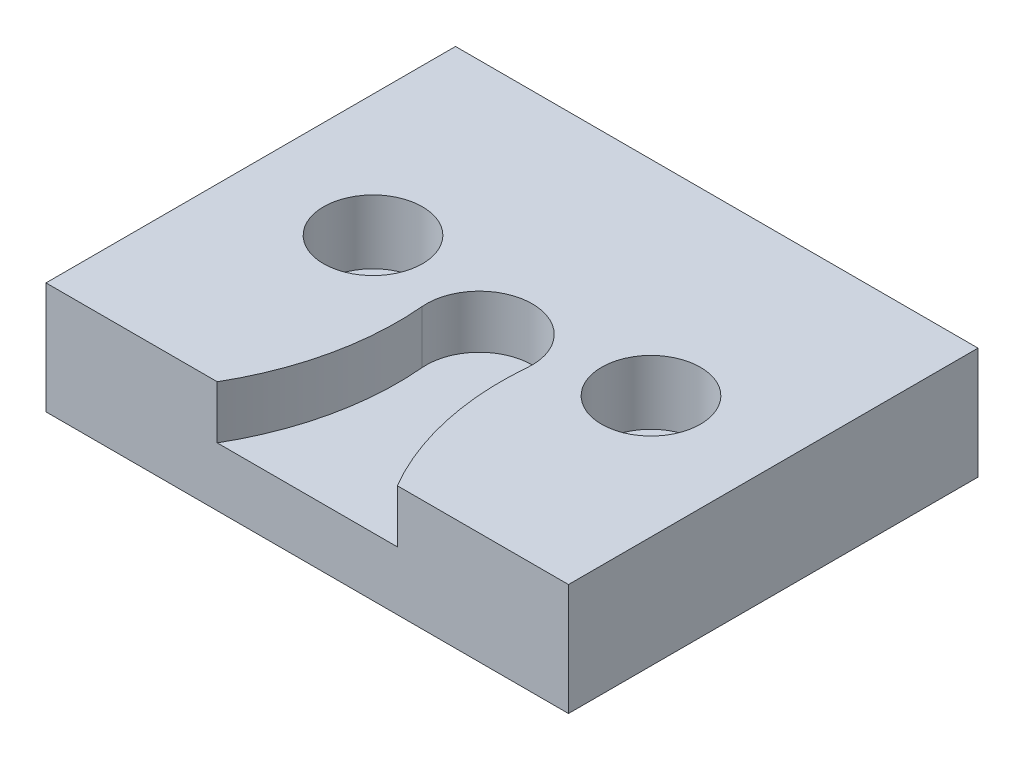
ISO-10303-21;
HEADER;
FILE_DESCRIPTION(('STEP AP214'),'2;1');
FILE_NAME('part.step','',(''),(''),'','','');
FILE_SCHEMA(('AUTOMOTIVE_DESIGN { 1 0 10303 214 1 1 1 1 }'));
ENDSEC;
DATA;
#1=APPLICATION_CONTEXT('core data for automotive mechanical design processes');
#2=APPLICATION_PROTOCOL_DEFINITION('international standard','automotive_design',2000,#1);
#3=PRODUCT_CONTEXT('',#1,'mechanical');
#4=PRODUCT('Part','Part','',(#3));
#5=PRODUCT_RELATED_PRODUCT_CATEGORY('part','',(#4));
#6=PRODUCT_DEFINITION_FORMATION('','',#4);
#7=PRODUCT_DEFINITION_CONTEXT('part definition',#1,'design');
#8=PRODUCT_DEFINITION('design','',#6,#7);
#9=PRODUCT_DEFINITION_SHAPE('','',#8);
#10=(LENGTH_UNIT() NAMED_UNIT(*) SI_UNIT(.MILLI.,.METRE.));
#11=(NAMED_UNIT(*) PLANE_ANGLE_UNIT() SI_UNIT($,.RADIAN.));
#12=(NAMED_UNIT(*) SI_UNIT($,.STERADIAN.) SOLID_ANGLE_UNIT());
#13=UNCERTAINTY_MEASURE_WITH_UNIT(LENGTH_MEASURE(1.E-05),#10,'distance_accuracy_value','');
#14=(GEOMETRIC_REPRESENTATION_CONTEXT(3) GLOBAL_UNCERTAINTY_ASSIGNED_CONTEXT((#13)) GLOBAL_UNIT_ASSIGNED_CONTEXT((#10,
#11,#12)) REPRESENTATION_CONTEXT('',''));
#15=CARTESIAN_POINT('',(0.,0.,0.));
#16=DIRECTION('',(0.,0.,1.));
#17=DIRECTION('',(1.,0.,0.));
#18=AXIS2_PLACEMENT_3D('',#15,#16,#17);
#19=CARTESIAN_POINT('',(0.,0.,0.));
#20=DIRECTION('',(0.,1.,0.));
#21=DIRECTION('',(0.,0.,1.));
#22=AXIS2_PLACEMENT_3D('',#19,#20,#21);
#23=PLANE('',#22);
#24=CARTESIAN_POINT('',(24.99995,0.,0.));
#25=DIRECTION('',(0.,1.,0.));
#26=DIRECTION('',(0.,0.,1.));
#27=AXIS2_PLACEMENT_3D('',#24,#25,#26);
#28=CIRCLE('',#27,8.89);
#29=CARTESIAN_POINT('',(24.99995,0.,8.89));
#30=VERTEX_POINT('',#29);
#31=EDGE_CURVE('E181',#30,#30,#28,.T.);
#32=ORIENTED_EDGE('',*,*,#31,.F.);
#33=EDGE_LOOP('',(#32));
#34=FACE_BOUND('',#33,.T.);
#35=CARTESIAN_POINT('',(-24.99995,0.,0.));
#36=DIRECTION('',(0.,1.,0.));
#37=DIRECTION('',(0.,0.,1.));
#38=AXIS2_PLACEMENT_3D('',#35,#36,#37);
#39=CIRCLE('',#38,8.89);
#40=CARTESIAN_POINT('',(-24.99995,0.,8.89));
#41=VERTEX_POINT('',#40);
#42=EDGE_CURVE('E165',#41,#41,#39,.T.);
#43=ORIENTED_EDGE('',*,*,#42,.F.);
#44=EDGE_LOOP('',(#43));
#45=FACE_BOUND('',#44,.T.);
#46=CARTESIAN_POINT('',(-60.0847810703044,0.,11.2524782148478));
#47=DIRECTION('',(0.,-1.,0.));
#48=DIRECTION('',(0.,0.,1.));
#49=AXIS2_PLACEMENT_3D('',#46,#47,#48);
#50=CIRCLE('',#49,50.8);
#51=CARTESIAN_POINT('',(-9.48711280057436,0.,6.72302287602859));
#52=VERTEX_POINT('',#51);
#53=CARTESIAN_POINT('',(-16.1936614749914,0.,36.83));
#54=VERTEX_POINT('',#53);
#55=EDGE_CURVE('E142',#52,#54,#50,.T.);
#56=ORIENTED_EDGE('',*,*,#55,.F.);
#57=CARTESIAN_POINT('',(-4.9999999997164E-05,0.,5.87374999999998));
#58=DIRECTION('',(0.,1.,0.));
#59=DIRECTION('',(0.,0.,1.));
#60=AXIS2_PLACEMENT_3D('',#57,#58,#59);
#61=CIRCLE('',#60,9.52499999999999);
#62=CARTESIAN_POINT('',(9.48701280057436,0.,6.72302287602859));
#63=VERTEX_POINT('',#62);
#64=EDGE_CURVE('E158',#63,#52,#61,.T.);
#65=ORIENTED_EDGE('',*,*,#64,.F.);
#66=CARTESIAN_POINT('',(60.0846810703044,0.,11.2524782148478));
#67=DIRECTION('',(0.,1.,0.));
#68=DIRECTION('',(0.,0.,1.));
#69=AXIS2_PLACEMENT_3D('',#66,#67,#68);
#70=CIRCLE('',#69,50.8);
#71=CARTESIAN_POINT('',(16.1935614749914,0.,36.83));
#72=VERTEX_POINT('',#71);
#73=EDGE_CURVE('E55',#72,#63,#70,.F.);
#74=ORIENTED_EDGE('',*,*,#73,.F.);
#75=DIRECTION('',(1.,0.,0.));
#76=VECTOR('',#75,1.);
#77=CARTESIAN_POINT('',(-46.99,0.,36.83));
#78=LINE('',#77,#76);
#79=CARTESIAN_POINT('',(46.99,0.,36.83));
#80=VERTEX_POINT('',#79);
#81=EDGE_CURVE('E264',#72,#80,#78,.T.);
#82=ORIENTED_EDGE('',*,*,#81,.T.);
#83=DIRECTION('',(0.,0.,-1.));
#84=VECTOR('',#83,1.);
#85=CARTESIAN_POINT('',(46.99,0.,-36.83));
#86=LINE('',#85,#84);
#87=CARTESIAN_POINT('',(46.99,0.,-36.83));
#88=VERTEX_POINT('',#87);
#89=EDGE_CURVE('E252',#80,#88,#86,.T.);
#90=ORIENTED_EDGE('',*,*,#89,.T.);
#91=DIRECTION('',(-1.,0.,0.));
#92=VECTOR('',#91,1.);
#93=CARTESIAN_POINT('',(-46.99,0.,-36.83));
#94=LINE('',#93,#92);
#95=CARTESIAN_POINT('',(-46.99,0.,-36.83));
#96=VERTEX_POINT('',#95);
#97=EDGE_CURVE('E256',#88,#96,#94,.T.);
#98=ORIENTED_EDGE('',*,*,#97,.T.);
#99=DIRECTION('',(0.,0.,1.));
#100=VECTOR('',#99,1.);
#101=CARTESIAN_POINT('',(-46.99,0.,-36.83));
#102=LINE('',#101,#100);
#103=CARTESIAN_POINT('',(-46.99,0.,36.83));
#104=VERTEX_POINT('',#103);
#105=EDGE_CURVE('E260',#96,#104,#102,.T.);
#106=ORIENTED_EDGE('',*,*,#105,.T.);
#107=EDGE_CURVE('E265',#104,#54,#78,.T.);
#108=ORIENTED_EDGE('',*,*,#107,.T.);
#109=EDGE_LOOP('',(#56,#65,#74,#82,#90,#98,#106,#108));
#110=FACE_BOUND('',#109,.T.);
#111=ADVANCED_FACE('F47',(#34,#45,#110),#23,.T.);
#112=CARTESIAN_POINT('',(46.99,-24.28875,-36.83));
#113=DIRECTION('',(1.,0.,0.));
#114=DIRECTION('',(0.,0.,-1.));
#115=AXIS2_PLACEMENT_3D('',#112,#113,#114);
#116=PLANE('',#115);
#117=DIRECTION('',(0.,1.,0.));
#118=VECTOR('',#117,1.);
#119=CARTESIAN_POINT('',(46.99,-24.28875,36.83));
#120=LINE('',#119,#118);
#121=CARTESIAN_POINT('',(46.99,-20.09775,36.83));
#122=VERTEX_POINT('',#121);
#123=EDGE_CURVE('E270',#122,#80,#120,.T.);
#124=ORIENTED_EDGE('',*,*,#123,.F.);
#125=DIRECTION('',(0.,0.,-1.));
#126=VECTOR('',#125,1.);
#127=CARTESIAN_POINT('',(46.99,-20.09775,-36.83));
#128=LINE('',#127,#126);
#129=CARTESIAN_POINT('',(46.99,-20.09775,-36.83));
#130=VERTEX_POINT('',#129);
#131=EDGE_CURVE('E248',#122,#130,#128,.T.);
#132=ORIENTED_EDGE('',*,*,#131,.T.);
#133=DIRECTION('',(0.,1.,0.));
#134=VECTOR('',#133,1.);
#135=CARTESIAN_POINT('',(46.99,-24.28875,-36.83));
#136=LINE('',#135,#134);
#137=EDGE_CURVE('E269',#130,#88,#136,.T.);
#138=ORIENTED_EDGE('',*,*,#137,.T.);
#139=ORIENTED_EDGE('',*,*,#89,.F.);
#140=EDGE_LOOP('',(#124,#132,#138,#139));
#141=FACE_BOUND('',#140,.T.);
#142=ADVANCED_FACE('F49',(#141),#116,.T.);
#143=CARTESIAN_POINT('',(-46.99,-24.28875,36.83));
#144=DIRECTION('',(0.,0.,1.));
#145=DIRECTION('',(1.,0.,0.));
#146=AXIS2_PLACEMENT_3D('',#143,#144,#145);
#147=PLANE('',#146);
#148=DIRECTION('',(0.,1.,0.));
#149=VECTOR('',#148,1.);
#150=CARTESIAN_POINT('',(-16.1936614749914,-9.525,36.83));
#151=LINE('',#150,#149);
#152=CARTESIAN_POINT('',(-16.1936614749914,-9.525,36.83));
#153=VERTEX_POINT('',#152);
#154=EDGE_CURVE('E163',#54,#153,#151,.F.);
#155=ORIENTED_EDGE('',*,*,#154,.F.);
#156=ORIENTED_EDGE('',*,*,#107,.F.);
#157=DIRECTION('',(0.,1.,0.));
#158=VECTOR('',#157,1.);
#159=CARTESIAN_POINT('',(-46.99,-24.28875,36.83));
#160=LINE('',#159,#158);
#161=CARTESIAN_POINT('',(-46.99,-20.09775,36.83));
#162=VERTEX_POINT('',#161);
#163=EDGE_CURVE('E275',#162,#104,#160,.T.);
#164=ORIENTED_EDGE('',*,*,#163,.F.);
#165=DIRECTION('',(1.,0.,0.));
#166=VECTOR('',#165,1.);
#167=CARTESIAN_POINT('',(-46.99,-20.09775,36.83));
#168=LINE('',#167,#166);
#169=EDGE_CURVE('E244',#162,#122,#168,.T.);
#170=ORIENTED_EDGE('',*,*,#169,.T.);
#171=ORIENTED_EDGE('',*,*,#123,.T.);
#172=ORIENTED_EDGE('',*,*,#81,.F.);
#173=DIRECTION('',(0.,1.,0.));
#174=VECTOR('',#173,1.);
#175=CARTESIAN_POINT('',(16.1935614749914,-9.525,36.83));
#176=LINE('',#175,#174);
#177=CARTESIAN_POINT('',(16.1935614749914,-9.525,36.83));
#178=VERTEX_POINT('',#177);
#179=EDGE_CURVE('E62',#178,#72,#176,.T.);
#180=ORIENTED_EDGE('',*,*,#179,.F.);
#181=DIRECTION('',(-1.,0.,0.));
#182=VECTOR('',#181,1.);
#183=CARTESIAN_POINT('',(-46.99,-9.525,36.83));
#184=LINE('',#183,#182);
#185=EDGE_CURVE('E11',#178,#153,#184,.T.);
#186=ORIENTED_EDGE('',*,*,#185,.T.);
#187=EDGE_LOOP('',(#155,#156,#164,#170,#171,#172,#180,#186));
#188=FACE_BOUND('',#187,.T.);
#189=ADVANCED_FACE('F305',(#188),#147,.T.);
#190=CARTESIAN_POINT('',(-46.99,-24.28875,-36.83));
#191=DIRECTION('',(-1.,0.,0.));
#192=DIRECTION('',(0.,0.,1.));
#193=AXIS2_PLACEMENT_3D('',#190,#191,#192);
#194=PLANE('',#193);
#195=DIRECTION('',(0.,1.,0.));
#196=VECTOR('',#195,1.);
#197=CARTESIAN_POINT('',(-46.99,-24.28875,-36.83));
#198=LINE('',#197,#196);
#199=CARTESIAN_POINT('',(-46.99,-20.09775,-36.83));
#200=VERTEX_POINT('',#199);
#201=EDGE_CURVE('E278',#200,#96,#198,.T.);
#202=ORIENTED_EDGE('',*,*,#201,.F.);
#203=DIRECTION('',(0.,0.,1.));
#204=VECTOR('',#203,1.);
#205=CARTESIAN_POINT('',(-46.99,-20.09775,-36.83));
#206=LINE('',#205,#204);
#207=EDGE_CURVE('E70',#200,#162,#206,.T.);
#208=ORIENTED_EDGE('',*,*,#207,.T.);
#209=ORIENTED_EDGE('',*,*,#163,.T.);
#210=ORIENTED_EDGE('',*,*,#105,.F.);
#211=EDGE_LOOP('',(#202,#208,#209,#210));
#212=FACE_BOUND('',#211,.T.);
#213=ADVANCED_FACE('F292',(#212),#194,.T.);
#214=CARTESIAN_POINT('',(-46.99,-24.28875,-36.83));
#215=DIRECTION('',(0.,0.,-1.));
#216=DIRECTION('',(-1.,0.,0.));
#217=AXIS2_PLACEMENT_3D('',#214,#215,#216);
#218=PLANE('',#217);
#219=ORIENTED_EDGE('',*,*,#137,.F.);
#220=DIRECTION('',(-1.,0.,0.));
#221=VECTOR('',#220,1.);
#222=CARTESIAN_POINT('',(-46.99,-20.09775,-36.83));
#223=LINE('',#222,#221);
#224=EDGE_CURVE('E274',#130,#200,#223,.T.);
#225=ORIENTED_EDGE('',*,*,#224,.T.);
#226=ORIENTED_EDGE('',*,*,#201,.T.);
#227=ORIENTED_EDGE('',*,*,#97,.F.);
#228=EDGE_LOOP('',(#219,#225,#226,#227));
#229=FACE_BOUND('',#228,.T.);
#230=ADVANCED_FACE('F288',(#229),#218,.T.);
#231=CARTESIAN_POINT('',(0.,-20.09775,0.));
#232=DIRECTION('',(0.,-1.,0.));
#233=DIRECTION('',(0.,0.,-1.));
#234=AXIS2_PLACEMENT_3D('',#231,#232,#233);
#235=PLANE('',#234);
#236=ORIENTED_EDGE('',*,*,#169,.F.);
#237=ORIENTED_EDGE('',*,*,#207,.F.);
#238=ORIENTED_EDGE('',*,*,#224,.F.);
#239=ORIENTED_EDGE('',*,*,#131,.F.);
#240=EDGE_LOOP('',(#236,#237,#238,#239));
#241=FACE_BOUND('',#240,.T.);
#242=DIRECTION('',(1.,0.,0.));
#243=VECTOR('',#242,1.);
#244=CARTESIAN_POINT('',(-34.925,-20.09775,-6.985));
#245=LINE('',#244,#243);
#246=CARTESIAN_POINT('',(-34.925,-20.09775,-6.985));
#247=VERTEX_POINT('',#246);
#248=CARTESIAN_POINT('',(34.925,-20.09775,-6.985));
#249=VERTEX_POINT('',#248);
#250=EDGE_CURVE('E211',#247,#249,#245,.T.);
#251=ORIENTED_EDGE('',*,*,#250,.F.);
#252=DIRECTION('',(0.,0.,-1.));
#253=VECTOR('',#252,1.);
#254=CARTESIAN_POINT('',(-34.925,-20.09775,6.985));
#255=LINE('',#254,#253);
#256=CARTESIAN_POINT('',(-34.925,-20.09775,6.985));
#257=VERTEX_POINT('',#256);
#258=EDGE_CURVE('E207',#257,#247,#255,.T.);
#259=ORIENTED_EDGE('',*,*,#258,.F.);
#260=DIRECTION('',(-1.,0.,0.));
#261=VECTOR('',#260,1.);
#262=CARTESIAN_POINT('',(-34.925,-20.09775,6.985));
#263=LINE('',#262,#261);
#264=CARTESIAN_POINT('',(34.925,-20.09775,6.985));
#265=VERTEX_POINT('',#264);
#266=EDGE_CURVE('E202',#265,#257,#263,.T.);
#267=ORIENTED_EDGE('',*,*,#266,.F.);
#268=DIRECTION('',(0.,0.,1.));
#269=VECTOR('',#268,1.);
#270=CARTESIAN_POINT('',(34.925,-20.09775,6.985));
#271=LINE('',#270,#269);
#272=EDGE_CURVE('E198',#249,#265,#271,.T.);
#273=ORIENTED_EDGE('',*,*,#272,.F.);
#274=EDGE_LOOP('',(#251,#259,#267,#273));
#275=FACE_BOUND('',#274,.T.);
#276=ADVANCED_FACE('F301',(#241,#275),#235,.T.);
#277=CARTESIAN_POINT('',(34.925,-20.09775,6.985));
#278=DIRECTION('',(1.,0.,0.));
#279=DIRECTION('',(0.,0.,-1.));
#280=AXIS2_PLACEMENT_3D('',#277,#278,#279);
#281=PLANE('',#280);
#282=DIRECTION('',(0.,0.,1.));
#283=VECTOR('',#282,1.);
#284=CARTESIAN_POINT('',(34.925,-24.28875,6.985));
#285=LINE('',#284,#283);
#286=CARTESIAN_POINT('',(34.925,-24.28875,-6.985));
#287=VERTEX_POINT('',#286);
#288=CARTESIAN_POINT('',(34.925,-24.28875,6.985));
#289=VERTEX_POINT('',#288);
#290=EDGE_CURVE('E197',#287,#289,#285,.T.);
#291=ORIENTED_EDGE('',*,*,#290,.F.);
#292=DIRECTION('',(0.,-1.,0.));
#293=VECTOR('',#292,1.);
#294=CARTESIAN_POINT('',(34.925,-20.09775,-6.985));
#295=LINE('',#294,#293);
#296=EDGE_CURVE('E230',#249,#287,#295,.T.);
#297=ORIENTED_EDGE('',*,*,#296,.F.);
#298=ORIENTED_EDGE('',*,*,#272,.T.);
#299=DIRECTION('',(0.,-1.,0.));
#300=VECTOR('',#299,1.);
#301=CARTESIAN_POINT('',(34.925,-20.09775,6.985));
#302=LINE('',#301,#300);
#303=EDGE_CURVE('E215',#265,#289,#302,.T.);
#304=ORIENTED_EDGE('',*,*,#303,.T.);
#305=EDGE_LOOP('',(#291,#297,#298,#304));
#306=FACE_BOUND('',#305,.T.);
#307=ADVANCED_FACE('F374',(#306),#281,.T.);
#308=CARTESIAN_POINT('',(-34.925,-20.09775,-6.985));
#309=DIRECTION('',(0.,0.,-1.));
#310=DIRECTION('',(-1.,0.,0.));
#311=AXIS2_PLACEMENT_3D('',#308,#309,#310);
#312=PLANE('',#311);
#313=DIRECTION('',(1.,0.,0.));
#314=VECTOR('',#313,1.);
#315=CARTESIAN_POINT('',(-34.925,-24.28875,-6.985));
#316=LINE('',#315,#314);
#317=CARTESIAN_POINT('',(-34.925,-24.28875,-6.985));
#318=VERTEX_POINT('',#317);
#319=EDGE_CURVE('E203',#318,#287,#316,.T.);
#320=ORIENTED_EDGE('',*,*,#319,.F.);
#321=DIRECTION('',(0.,-1.,0.));
#322=VECTOR('',#321,1.);
#323=CARTESIAN_POINT('',(-34.925,-20.09775,-6.985));
#324=LINE('',#323,#322);
#325=EDGE_CURVE('E233',#247,#318,#324,.T.);
#326=ORIENTED_EDGE('',*,*,#325,.F.);
#327=ORIENTED_EDGE('',*,*,#250,.T.);
#328=ORIENTED_EDGE('',*,*,#296,.T.);
#329=EDGE_LOOP('',(#320,#326,#327,#328));
#330=FACE_BOUND('',#329,.T.);
#331=ADVANCED_FACE('F379',(#330),#312,.T.);
#332=CARTESIAN_POINT('',(-34.925,-20.09775,6.985));
#333=DIRECTION('',(-1.,0.,0.));
#334=DIRECTION('',(0.,0.,1.));
#335=AXIS2_PLACEMENT_3D('',#332,#333,#334);
#336=PLANE('',#335);
#337=DIRECTION('',(0.,0.,-1.));
#338=VECTOR('',#337,1.);
#339=CARTESIAN_POINT('',(-34.925,-24.28875,6.985));
#340=LINE('',#339,#338);
#341=CARTESIAN_POINT('',(-34.925,-24.28875,6.985));
#342=VERTEX_POINT('',#341);
#343=EDGE_CURVE('E223',#342,#318,#340,.T.);
#344=ORIENTED_EDGE('',*,*,#343,.F.);
#345=DIRECTION('',(0.,-1.,0.));
#346=VECTOR('',#345,1.);
#347=CARTESIAN_POINT('',(-34.925,-20.09775,6.985));
#348=LINE('',#347,#346);
#349=EDGE_CURVE('E236',#257,#342,#348,.T.);
#350=ORIENTED_EDGE('',*,*,#349,.F.);
#351=ORIENTED_EDGE('',*,*,#258,.T.);
#352=ORIENTED_EDGE('',*,*,#325,.T.);
#353=EDGE_LOOP('',(#344,#350,#351,#352));
#354=FACE_BOUND('',#353,.T.);
#355=ADVANCED_FACE('F386',(#354),#336,.T.);
#356=CARTESIAN_POINT('',(-34.925,-20.09775,6.985));
#357=DIRECTION('',(0.,0.,1.));
#358=DIRECTION('',(1.,0.,0.));
#359=AXIS2_PLACEMENT_3D('',#356,#357,#358);
#360=PLANE('',#359);
#361=DIRECTION('',(-1.,0.,0.));
#362=VECTOR('',#361,1.);
#363=CARTESIAN_POINT('',(-34.925,-24.28875,6.985));
#364=LINE('',#363,#362);
#365=EDGE_CURVE('E219',#289,#342,#364,.T.);
#366=ORIENTED_EDGE('',*,*,#365,.F.);
#367=ORIENTED_EDGE('',*,*,#303,.F.);
#368=ORIENTED_EDGE('',*,*,#266,.T.);
#369=ORIENTED_EDGE('',*,*,#349,.T.);
#370=EDGE_LOOP('',(#366,#367,#368,#369));
#371=FACE_BOUND('',#370,.T.);
#372=ADVANCED_FACE('F383',(#371),#360,.T.);
#373=CARTESIAN_POINT('',(0.,-24.28875,0.));
#374=DIRECTION('',(0.,1.,0.));
#375=DIRECTION('',(0.,0.,1.));
#376=AXIS2_PLACEMENT_3D('',#373,#374,#375);
#377=PLANE('',#376);
#378=CARTESIAN_POINT('',(-24.99995,-24.28875,0.));
#379=DIRECTION('',(0.,1.,0.));
#380=DIRECTION('',(0.,0.,1.));
#381=AXIS2_PLACEMENT_3D('',#378,#379,#380);
#382=CIRCLE('',#381,5.55625);
#383=CARTESIAN_POINT('',(-24.99995,-24.28875,5.55625));
#384=VERTEX_POINT('',#383);
#385=EDGE_CURVE('E177',#384,#384,#382,.T.);
#386=ORIENTED_EDGE('',*,*,#385,.T.);
#387=EDGE_LOOP('',(#386));
#388=FACE_BOUND('',#387,.T.);
#389=CARTESIAN_POINT('',(24.99995,-24.28875,0.));
#390=DIRECTION('',(0.,1.,0.));
#391=DIRECTION('',(0.,0.,1.));
#392=AXIS2_PLACEMENT_3D('',#389,#390,#391);
#393=CIRCLE('',#392,5.55625);
#394=CARTESIAN_POINT('',(24.99995,-24.28875,5.55625));
#395=VERTEX_POINT('',#394);
#396=EDGE_CURVE('E193',#395,#395,#393,.T.);
#397=ORIENTED_EDGE('',*,*,#396,.T.);
#398=EDGE_LOOP('',(#397));
#399=FACE_BOUND('',#398,.T.);
#400=ORIENTED_EDGE('',*,*,#290,.T.);
#401=ORIENTED_EDGE('',*,*,#365,.T.);
#402=ORIENTED_EDGE('',*,*,#343,.T.);
#403=ORIENTED_EDGE('',*,*,#319,.T.);
#404=EDGE_LOOP('',(#400,#401,#402,#403));
#405=FACE_BOUND('',#404,.T.);
#406=ADVANCED_FACE('F365',(#388,#399,#405),#377,.F.);
#407=CARTESIAN_POINT('',(24.99995,0.,0.));
#408=DIRECTION('',(0.,1.,0.));
#409=DIRECTION('',(0.,0.,1.));
#410=AXIS2_PLACEMENT_3D('',#407,#408,#409);
#411=CYLINDRICAL_SURFACE('',#410,5.55625);
#412=ORIENTED_EDGE('',*,*,#396,.F.);
#413=EDGE_LOOP('',(#412));
#414=FACE_BOUND('',#413,.T.);
#415=CARTESIAN_POINT('',(24.99995,-11.509375,0.));
#416=DIRECTION('',(0.,1.,0.));
#417=DIRECTION('',(0.,0.,1.));
#418=AXIS2_PLACEMENT_3D('',#415,#416,#417);
#419=CIRCLE('',#418,5.55625);
#420=CARTESIAN_POINT('',(24.99995,-11.509375,5.55625));
#421=VERTEX_POINT('',#420);
#422=EDGE_CURVE('E189',#421,#421,#419,.T.);
#423=ORIENTED_EDGE('',*,*,#422,.T.);
#424=EDGE_LOOP('',(#423));
#425=FACE_BOUND('',#424,.T.);
#426=ADVANCED_FACE('F394',(#414,#425),#411,.F.);
#427=CARTESIAN_POINT('',(30.5562,-11.509375,0.));
#428=DIRECTION('',(0.,-1.,0.));
#429=DIRECTION('',(0.,0.,-1.));
#430=AXIS2_PLACEMENT_3D('',#427,#428,#429);
#431=PLANE('',#430);
#432=ORIENTED_EDGE('',*,*,#422,.F.);
#433=EDGE_LOOP('',(#432));
#434=FACE_BOUND('',#433,.T.);
#435=CARTESIAN_POINT('',(24.99995,-11.509375,0.));
#436=DIRECTION('',(0.,1.,0.));
#437=DIRECTION('',(0.,0.,1.));
#438=AXIS2_PLACEMENT_3D('',#435,#436,#437);
#439=CIRCLE('',#438,8.89);
#440=CARTESIAN_POINT('',(24.99995,-11.509375,8.89));
#441=VERTEX_POINT('',#440);
#442=EDGE_CURVE('E185',#441,#441,#439,.T.);
#443=ORIENTED_EDGE('',*,*,#442,.T.);
#444=EDGE_LOOP('',(#443));
#445=FACE_BOUND('',#444,.T.);
#446=ADVANCED_FACE('F397',(#434,#445),#431,.F.);
#447=CARTESIAN_POINT('',(24.99995,0.,0.));
#448=DIRECTION('',(0.,1.,0.));
#449=DIRECTION('',(0.,0.,1.));
#450=AXIS2_PLACEMENT_3D('',#447,#448,#449);
#451=CYLINDRICAL_SURFACE('',#450,8.89);
#452=ORIENTED_EDGE('',*,*,#442,.F.);
#453=EDGE_LOOP('',(#452));
#454=FACE_BOUND('',#453,.T.);
#455=ORIENTED_EDGE('',*,*,#31,.T.);
#456=EDGE_LOOP('',(#455));
#457=FACE_BOUND('',#456,.T.);
#458=ADVANCED_FACE('F401',(#454,#457),#451,.F.);
#459=CARTESIAN_POINT('',(-24.99995,0.,0.));
#460=DIRECTION('',(0.,1.,0.));
#461=DIRECTION('',(0.,0.,1.));
#462=AXIS2_PLACEMENT_3D('',#459,#460,#461);
#463=CYLINDRICAL_SURFACE('',#462,5.55625);
#464=ORIENTED_EDGE('',*,*,#385,.F.);
#465=EDGE_LOOP('',(#464));
#466=FACE_BOUND('',#465,.T.);
#467=CARTESIAN_POINT('',(-24.99995,-11.509375,0.));
#468=DIRECTION('',(0.,1.,0.));
#469=DIRECTION('',(0.,0.,1.));
#470=AXIS2_PLACEMENT_3D('',#467,#468,#469);
#471=CIRCLE('',#470,5.55625);
#472=CARTESIAN_POINT('',(-24.99995,-11.509375,5.55625));
#473=VERTEX_POINT('',#472);
#474=EDGE_CURVE('E173',#473,#473,#471,.T.);
#475=ORIENTED_EDGE('',*,*,#474,.T.);
#476=EDGE_LOOP('',(#475));
#477=FACE_BOUND('',#476,.T.);
#478=ADVANCED_FACE('F405',(#466,#477),#463,.F.);
#479=CARTESIAN_POINT('',(-19.4437,-11.509375,0.));
#480=DIRECTION('',(0.,-1.,0.));
#481=DIRECTION('',(0.,0.,-1.));
#482=AXIS2_PLACEMENT_3D('',#479,#480,#481);
#483=PLANE('',#482);
#484=ORIENTED_EDGE('',*,*,#474,.F.);
#485=EDGE_LOOP('',(#484));
#486=FACE_BOUND('',#485,.T.);
#487=CARTESIAN_POINT('',(-24.99995,-11.509375,0.));
#488=DIRECTION('',(0.,1.,0.));
#489=DIRECTION('',(0.,0.,1.));
#490=AXIS2_PLACEMENT_3D('',#487,#488,#489);
#491=CIRCLE('',#490,8.89);
#492=CARTESIAN_POINT('',(-24.99995,-11.509375,8.89));
#493=VERTEX_POINT('',#492);
#494=EDGE_CURVE('E169',#493,#493,#491,.T.);
#495=ORIENTED_EDGE('',*,*,#494,.T.);
#496=EDGE_LOOP('',(#495));
#497=FACE_BOUND('',#496,.T.);
#498=ADVANCED_FACE('F350',(#486,#497),#483,.F.);
#499=CARTESIAN_POINT('',(-24.99995,0.,0.));
#500=DIRECTION('',(0.,1.,0.));
#501=DIRECTION('',(0.,0.,1.));
#502=AXIS2_PLACEMENT_3D('',#499,#500,#501);
#503=CYLINDRICAL_SURFACE('',#502,8.89);
#504=ORIENTED_EDGE('',*,*,#494,.F.);
#505=EDGE_LOOP('',(#504));
#506=FACE_BOUND('',#505,.T.);
#507=ORIENTED_EDGE('',*,*,#42,.T.);
#508=EDGE_LOOP('',(#507));
#509=FACE_BOUND('',#508,.T.);
#510=ADVANCED_FACE('F342',(#506,#509),#503,.F.);
#511=CARTESIAN_POINT('',(-60.0847810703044,-9.525,11.2524782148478));
#512=DIRECTION('',(0.,1.,0.));
#513=DIRECTION('',(0.,0.,1.));
#514=AXIS2_PLACEMENT_3D('',#511,#512,#513);
#515=CYLINDRICAL_SURFACE('',#514,50.8);
#516=ORIENTED_EDGE('',*,*,#154,.T.);
#517=CARTESIAN_POINT('',(-60.0847810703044,-9.525,11.2524782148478));
#518=DIRECTION('',(0.,-1.,0.));
#519=DIRECTION('',(0.,0.,1.));
#520=AXIS2_PLACEMENT_3D('',#517,#518,#519);
#521=CIRCLE('',#520,50.8);
#522=CARTESIAN_POINT('',(-9.48711280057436,-9.525,6.72302287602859));
#523=VERTEX_POINT('',#522);
#524=EDGE_CURVE('E151',#523,#153,#521,.T.);
#525=ORIENTED_EDGE('',*,*,#524,.F.);
#526=DIRECTION('',(0.,1.,0.));
#527=VECTOR('',#526,1.);
#528=CARTESIAN_POINT('',(-9.48711280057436,-9.525,6.72302287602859));
#529=LINE('',#528,#527);
#530=EDGE_CURVE('E150',#523,#52,#529,.T.);
#531=ORIENTED_EDGE('',*,*,#530,.T.);
#532=ORIENTED_EDGE('',*,*,#55,.T.);
#533=EDGE_LOOP('',(#516,#525,#531,#532));
#534=FACE_BOUND('',#533,.T.);
#535=ADVANCED_FACE('F307',(#534),#515,.T.);
#536=CARTESIAN_POINT('',(-4.9999999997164E-05,-9.525,5.87374999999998));
#537=DIRECTION('',(0.,1.,0.));
#538=DIRECTION('',(0.,0.,1.));
#539=AXIS2_PLACEMENT_3D('',#536,#537,#538);
#540=CYLINDRICAL_SURFACE('',#539,9.52499999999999);
#541=ORIENTED_EDGE('',*,*,#64,.T.);
#542=ORIENTED_EDGE('',*,*,#530,.F.);
#543=CARTESIAN_POINT('',(-4.9999999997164E-05,-9.525,5.87374999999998));
#544=DIRECTION('',(0.,1.,0.));
#545=DIRECTION('',(0.,0.,1.));
#546=AXIS2_PLACEMENT_3D('',#543,#544,#545);
#547=CIRCLE('',#546,9.52499999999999);
#548=CARTESIAN_POINT('',(9.48701280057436,-9.525,6.72302287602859));
#549=VERTEX_POINT('',#548);
#550=EDGE_CURVE('E141',#549,#523,#547,.T.);
#551=ORIENTED_EDGE('',*,*,#550,.F.);
#552=DIRECTION('',(0.,1.,0.));
#553=VECTOR('',#552,1.);
#554=CARTESIAN_POINT('',(9.48701280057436,-9.525,6.72302287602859));
#555=LINE('',#554,#553);
#556=EDGE_CURVE('E145',#549,#63,#555,.T.);
#557=ORIENTED_EDGE('',*,*,#556,.T.);
#558=EDGE_LOOP('',(#541,#542,#551,#557));
#559=FACE_BOUND('',#558,.T.);
#560=ADVANCED_FACE('F153',(#559),#540,.F.);
#561=CARTESIAN_POINT('',(60.0846810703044,-9.525,11.2524782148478));
#562=DIRECTION('',(0.,1.,0.));
#563=DIRECTION('',(0.,0.,1.));
#564=AXIS2_PLACEMENT_3D('',#561,#562,#563);
#565=CYLINDRICAL_SURFACE('',#564,50.8);
#566=ORIENTED_EDGE('',*,*,#179,.T.);
#567=ORIENTED_EDGE('',*,*,#73,.T.);
#568=ORIENTED_EDGE('',*,*,#556,.F.);
#569=CARTESIAN_POINT('',(60.0846810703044,-9.525,11.2524782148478));
#570=DIRECTION('',(0.,-1.,0.));
#571=DIRECTION('',(0.,0.,1.));
#572=AXIS2_PLACEMENT_3D('',#569,#570,#571);
#573=CIRCLE('',#572,50.8);
#574=EDGE_CURVE('E136',#178,#549,#573,.T.);
#575=ORIENTED_EDGE('',*,*,#574,.F.);
#576=EDGE_LOOP('',(#566,#567,#568,#575));
#577=FACE_BOUND('',#576,.T.);
#578=ADVANCED_FACE('F146',(#577),#565,.T.);
#579=CARTESIAN_POINT('',(25.39995,-9.525,56.67375));
#580=DIRECTION('',(0.,1.,0.));
#581=DIRECTION('',(0.,0.,1.));
#582=AXIS2_PLACEMENT_3D('',#579,#580,#581);
#583=PLANE('',#582);
#584=ORIENTED_EDGE('',*,*,#574,.T.);
#585=ORIENTED_EDGE('',*,*,#550,.T.);
#586=ORIENTED_EDGE('',*,*,#524,.T.);
#587=ORIENTED_EDGE('',*,*,#185,.F.);
#588=EDGE_LOOP('',(#584,#585,#586,#587));
#589=FACE_BOUND('',#588,.T.);
#590=ADVANCED_FACE('F138',(#589),#583,.T.);
#591=CLOSED_SHELL('',(#111,#142,#189,#213,#230,#276,#307,#331,#355,#372,#406,#426,#446,#458,
#478,#498,#510,#535,#560,#578,#590));
#592=MANIFOLD_SOLID_BREP('B2',#591);
#593=ADVANCED_BREP_SHAPE_REPRESENTATION('',(#18,#592),#14);
#594=SHAPE_DEFINITION_REPRESENTATION(#9,#593);
ENDSEC;
END-ISO-10303-21;
